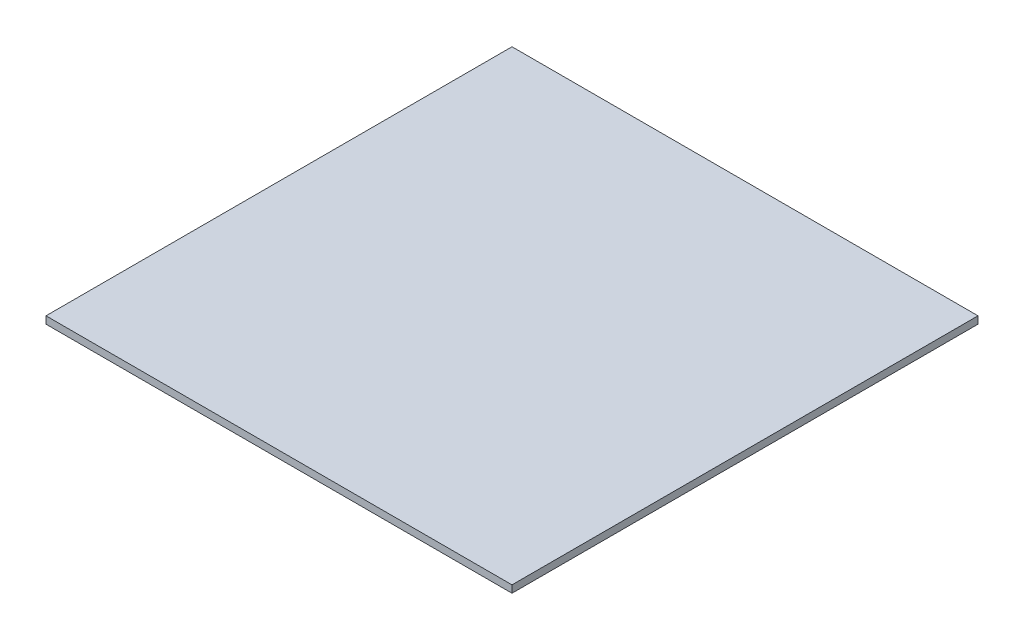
ISO-10303-21;
HEADER;
FILE_DESCRIPTION(('STEP AP214'),'2;1');
FILE_NAME('part.step','',(''),(''),'','','');
FILE_SCHEMA(('AUTOMOTIVE_DESIGN { 1 0 10303 214 1 1 1 1 }'));
ENDSEC;
DATA;
#1=APPLICATION_CONTEXT('core data for automotive mechanical design processes');
#2=APPLICATION_PROTOCOL_DEFINITION('international standard','automotive_design',2000,#1);
#3=PRODUCT_CONTEXT('',#1,'mechanical');
#4=PRODUCT('Part','Part','',(#3));
#5=PRODUCT_RELATED_PRODUCT_CATEGORY('part','',(#4));
#6=PRODUCT_DEFINITION_FORMATION('','',#4);
#7=PRODUCT_DEFINITION_CONTEXT('part definition',#1,'design');
#8=PRODUCT_DEFINITION('design','',#6,#7);
#9=PRODUCT_DEFINITION_SHAPE('','',#8);
#10=(LENGTH_UNIT() NAMED_UNIT(*) SI_UNIT(.MILLI.,.METRE.));
#11=(NAMED_UNIT(*) PLANE_ANGLE_UNIT() SI_UNIT($,.RADIAN.));
#12=(NAMED_UNIT(*) SI_UNIT($,.STERADIAN.) SOLID_ANGLE_UNIT());
#13=UNCERTAINTY_MEASURE_WITH_UNIT(LENGTH_MEASURE(1.E-05),#10,'distance_accuracy_value','');
#14=(GEOMETRIC_REPRESENTATION_CONTEXT(3) GLOBAL_UNCERTAINTY_ASSIGNED_CONTEXT((#13)) GLOBAL_UNIT_ASSIGNED_CONTEXT((#10,
#11,#12)) REPRESENTATION_CONTEXT('',''));
#15=CARTESIAN_POINT('',(0.,0.,0.));
#16=DIRECTION('',(0.,0.,1.));
#17=DIRECTION('',(1.,0.,0.));
#18=AXIS2_PLACEMENT_3D('',#15,#16,#17);
#19=CARTESIAN_POINT('',(-609.6,19.0500000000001,609.6));
#20=DIRECTION('',(0.999999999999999,0.,0.));
#21=DIRECTION('',(0.,0.,-1.));
#22=AXIS2_PLACEMENT_3D('',#19,#20,#21);
#23=PLANE('',#22);
#24=DIRECTION('',(0.,0.,1.));
#25=VECTOR('',#24,1.);
#26=CARTESIAN_POINT('',(-609.6,0.,609.6));
#27=LINE('',#26,#25);
#28=CARTESIAN_POINT('',(-609.6,1.11022302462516E-13,-609.6));
#29=VERTEX_POINT('',#28);
#30=CARTESIAN_POINT('',(-609.6,0.,609.6));
#31=VERTEX_POINT('',#30);
#32=EDGE_CURVE('E97',#29,#31,#27,.T.);
#33=ORIENTED_EDGE('',*,*,#32,.T.);
#34=DIRECTION('',(0.,-1.,0.));
#35=VECTOR('',#34,1.);
#36=CARTESIAN_POINT('',(-609.6,19.0500000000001,609.6));
#37=LINE('',#36,#35);
#38=CARTESIAN_POINT('',(-609.6,19.0500000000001,609.6));
#39=VERTEX_POINT('',#38);
#40=EDGE_CURVE('E11',#39,#31,#37,.T.);
#41=ORIENTED_EDGE('',*,*,#40,.F.);
#42=DIRECTION('',(0.,0.,1.));
#43=VECTOR('',#42,1.);
#44=CARTESIAN_POINT('',(-609.6,19.0500000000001,609.6));
#45=LINE('',#44,#43);
#46=CARTESIAN_POINT('',(-609.6,19.05,-609.6));
#47=VERTEX_POINT('',#46);
#48=EDGE_CURVE('E85',#47,#39,#45,.T.);
#49=ORIENTED_EDGE('',*,*,#48,.F.);
#50=DIRECTION('',(0.,-1.,0.));
#51=VECTOR('',#50,1.);
#52=CARTESIAN_POINT('',(-609.6,19.05,-609.6));
#53=LINE('',#52,#51);
#54=EDGE_CURVE('E93',#47,#29,#53,.T.);
#55=ORIENTED_EDGE('',*,*,#54,.T.);
#56=EDGE_LOOP('',(#33,#41,#49,#55));
#57=FACE_BOUND('',#56,.T.);
#58=ADVANCED_FACE('F34',(#57),#23,.F.);
#59=CARTESIAN_POINT('',(-609.6,19.0500000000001,609.6));
#60=DIRECTION('',(0.,0.,-1.));
#61=DIRECTION('',(-1.,0.,0.));
#62=AXIS2_PLACEMENT_3D('',#59,#60,#61);
#63=PLANE('',#62);
#64=DIRECTION('',(0.999999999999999,0.,0.));
#65=VECTOR('',#64,1.);
#66=CARTESIAN_POINT('',(-609.6,0.,609.6));
#67=LINE('',#66,#65);
#68=CARTESIAN_POINT('',(609.599999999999,0.,609.599999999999));
#69=VERTEX_POINT('',#68);
#70=EDGE_CURVE('E89',#31,#69,#67,.T.);
#71=ORIENTED_EDGE('',*,*,#70,.T.);
#72=DIRECTION('',(0.,-1.,0.));
#73=VECTOR('',#72,1.);
#74=CARTESIAN_POINT('',(609.599999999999,19.05,609.6));
#75=LINE('',#74,#73);
#76=CARTESIAN_POINT('',(609.599999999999,19.05,609.6));
#77=VERTEX_POINT('',#76);
#78=EDGE_CURVE('E42',#77,#69,#75,.T.);
#79=ORIENTED_EDGE('',*,*,#78,.F.);
#80=DIRECTION('',(0.999999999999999,0.,0.));
#81=VECTOR('',#80,1.);
#82=CARTESIAN_POINT('',(-609.6,19.0500000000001,609.6));
#83=LINE('',#82,#81);
#84=EDGE_CURVE('E80',#39,#77,#83,.T.);
#85=ORIENTED_EDGE('',*,*,#84,.F.);
#86=ORIENTED_EDGE('',*,*,#40,.T.);
#87=EDGE_LOOP('',(#71,#79,#85,#86));
#88=FACE_BOUND('',#87,.T.);
#89=ADVANCED_FACE('F88',(#88),#63,.F.);
#90=CARTESIAN_POINT('',(609.599999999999,19.05,609.6));
#91=DIRECTION('',(-0.999999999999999,0.,0.));
#92=DIRECTION('',(0.,0.,1.));
#93=AXIS2_PLACEMENT_3D('',#90,#91,#92);
#94=PLANE('',#93);
#95=DIRECTION('',(0.,0.,-1.));
#96=VECTOR('',#95,1.);
#97=CARTESIAN_POINT('',(609.599999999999,0.,609.599999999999));
#98=LINE('',#97,#96);
#99=CARTESIAN_POINT('',(609.599999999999,1.11022302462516E-13,-609.599999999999));
#100=VERTEX_POINT('',#99);
#101=EDGE_CURVE('E67',#69,#100,#98,.T.);
#102=ORIENTED_EDGE('',*,*,#101,.T.);
#103=DIRECTION('',(0.,-1.,0.));
#104=VECTOR('',#103,1.);
#105=CARTESIAN_POINT('',(609.599999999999,19.05,-609.599999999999));
#106=LINE('',#105,#104);
#107=CARTESIAN_POINT('',(609.599999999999,19.05,-609.599999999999));
#108=VERTEX_POINT('',#107);
#109=EDGE_CURVE('E90',#108,#100,#106,.T.);
#110=ORIENTED_EDGE('',*,*,#109,.F.);
#111=DIRECTION('',(0.,0.,-1.));
#112=VECTOR('',#111,1.);
#113=CARTESIAN_POINT('',(609.599999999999,19.05,609.6));
#114=LINE('',#113,#112);
#115=EDGE_CURVE('E83',#77,#108,#114,.T.);
#116=ORIENTED_EDGE('',*,*,#115,.F.);
#117=ORIENTED_EDGE('',*,*,#78,.T.);
#118=EDGE_LOOP('',(#102,#110,#116,#117));
#119=FACE_BOUND('',#118,.T.);
#120=ADVANCED_FACE('F91',(#119),#94,.F.);
#121=CARTESIAN_POINT('',(-609.6,19.05,-609.6));
#122=DIRECTION('',(0.,0.,1.));
#123=DIRECTION('',(1.,0.,0.));
#124=AXIS2_PLACEMENT_3D('',#121,#122,#123);
#125=PLANE('',#124);
#126=DIRECTION('',(-0.999999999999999,0.,0.));
#127=VECTOR('',#126,1.);
#128=CARTESIAN_POINT('',(-609.6,1.11022302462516E-13,-609.6));
#129=LINE('',#128,#127);
#130=EDGE_CURVE('E73',#100,#29,#129,.T.);
#131=ORIENTED_EDGE('',*,*,#130,.T.);
#132=ORIENTED_EDGE('',*,*,#54,.F.);
#133=DIRECTION('',(-0.999999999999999,0.,0.));
#134=VECTOR('',#133,1.);
#135=CARTESIAN_POINT('',(-609.6,19.05,-609.6));
#136=LINE('',#135,#134);
#137=EDGE_CURVE('E50',#108,#47,#136,.T.);
#138=ORIENTED_EDGE('',*,*,#137,.F.);
#139=ORIENTED_EDGE('',*,*,#109,.T.);
#140=EDGE_LOOP('',(#131,#132,#138,#139));
#141=FACE_BOUND('',#140,.T.);
#142=ADVANCED_FACE('F104',(#141),#125,.F.);
#143=CARTESIAN_POINT('',(-609.6,19.05,-609.6));
#144=DIRECTION('',(0.,-1.,0.));
#145=DIRECTION('',(0.,0.,-1.));
#146=AXIS2_PLACEMENT_3D('',#143,#144,#145);
#147=PLANE('',#146);
#148=ORIENTED_EDGE('',*,*,#48,.T.);
#149=ORIENTED_EDGE('',*,*,#84,.T.);
#150=ORIENTED_EDGE('',*,*,#115,.T.);
#151=ORIENTED_EDGE('',*,*,#137,.T.);
#152=EDGE_LOOP('',(#148,#149,#150,#151));
#153=FACE_BOUND('',#152,.T.);
#154=ADVANCED_FACE('F81',(#153),#147,.F.);
#155=CARTESIAN_POINT('',(-609.6,1.11022302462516E-13,-609.6));
#156=DIRECTION('',(0.,-1.,0.));
#157=DIRECTION('',(0.,0.,-1.));
#158=AXIS2_PLACEMENT_3D('',#155,#156,#157);
#159=PLANE('',#158);
#160=ORIENTED_EDGE('',*,*,#32,.F.);
#161=ORIENTED_EDGE('',*,*,#130,.F.);
#162=ORIENTED_EDGE('',*,*,#101,.F.);
#163=ORIENTED_EDGE('',*,*,#70,.F.);
#164=EDGE_LOOP('',(#160,#161,#162,#163));
#165=FACE_BOUND('',#164,.T.);
#166=ADVANCED_FACE('F107',(#165),#159,.T.);
#167=CLOSED_SHELL('',(#58,#89,#120,#142,#154,#166));
#168=MANIFOLD_SOLID_BREP('B2',#167);
#169=ADVANCED_BREP_SHAPE_REPRESENTATION('',(#18,#168),#14);
#170=SHAPE_DEFINITION_REPRESENTATION(#9,#169);
ENDSEC;
END-ISO-10303-21;
